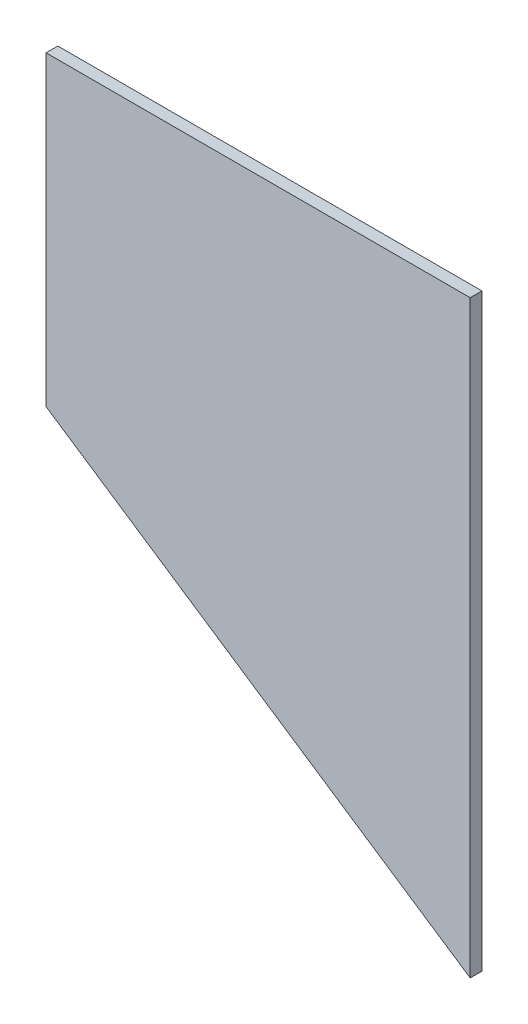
ISO-10303-21;
HEADER;
FILE_DESCRIPTION(('STEP AP214'),'2;1');
FILE_NAME('part.step','',(''),(''),'','','');
FILE_SCHEMA(('AUTOMOTIVE_DESIGN { 1 0 10303 214 1 1 1 1 }'));
ENDSEC;
DATA;
#1=APPLICATION_CONTEXT('core data for automotive mechanical design processes');
#2=APPLICATION_PROTOCOL_DEFINITION('international standard','automotive_design',2000,#1);
#3=PRODUCT_CONTEXT('',#1,'mechanical');
#4=PRODUCT('Part','Part','',(#3));
#5=PRODUCT_RELATED_PRODUCT_CATEGORY('part','',(#4));
#6=PRODUCT_DEFINITION_FORMATION('','',#4);
#7=PRODUCT_DEFINITION_CONTEXT('part definition',#1,'design');
#8=PRODUCT_DEFINITION('design','',#6,#7);
#9=PRODUCT_DEFINITION_SHAPE('','',#8);
#10=(LENGTH_UNIT() NAMED_UNIT(*) SI_UNIT(.MILLI.,.METRE.));
#11=(NAMED_UNIT(*) PLANE_ANGLE_UNIT() SI_UNIT($,.RADIAN.));
#12=(NAMED_UNIT(*) SI_UNIT($,.STERADIAN.) SOLID_ANGLE_UNIT());
#13=UNCERTAINTY_MEASURE_WITH_UNIT(LENGTH_MEASURE(1.E-05),#10,'distance_accuracy_value','');
#14=(GEOMETRIC_REPRESENTATION_CONTEXT(3) GLOBAL_UNCERTAINTY_ASSIGNED_CONTEXT((#13)) GLOBAL_UNIT_ASSIGNED_CONTEXT((#10,
#11,#12)) REPRESENTATION_CONTEXT('',''));
#15=CARTESIAN_POINT('',(0.,0.,0.));
#16=DIRECTION('',(0.,0.,1.));
#17=DIRECTION('',(1.,0.,0.));
#18=AXIS2_PLACEMENT_3D('',#15,#16,#17);
#19=CARTESIAN_POINT('',(304.8,0.,0.));
#20=DIRECTION('',(-1.,0.,0.));
#21=DIRECTION('',(0.,0.,1.));
#22=AXIS2_PLACEMENT_3D('',#19,#20,#21);
#23=PLANE('',#22);
#24=DIRECTION('',(0.,0.,-1.));
#25=VECTOR('',#24,1.);
#26=CARTESIAN_POINT('',(304.8,-158.75,152.4));
#27=LINE('',#26,#25);
#28=CARTESIAN_POINT('',(304.8,-158.75,158.75));
#29=VERTEX_POINT('',#28);
#30=CARTESIAN_POINT('',(304.8,-158.75,152.4));
#31=VERTEX_POINT('',#30);
#32=EDGE_CURVE('E128',#29,#31,#27,.T.);
#33=ORIENTED_EDGE('',*,*,#32,.T.);
#34=DIRECTION('',(0.,1.,0.));
#35=VECTOR('',#34,1.);
#36=CARTESIAN_POINT('',(304.8,-158.75,152.4));
#37=LINE('',#36,#35);
#38=CARTESIAN_POINT('',(304.8,158.75,152.4));
#39=VERTEX_POINT('',#38);
#40=EDGE_CURVE('E12',#31,#39,#37,.T.);
#41=ORIENTED_EDGE('',*,*,#40,.T.);
#42=DIRECTION('',(0.,0.,1.));
#43=VECTOR('',#42,1.);
#44=CARTESIAN_POINT('',(304.8,158.75,152.4));
#45=LINE('',#44,#43);
#46=CARTESIAN_POINT('',(304.8,158.75,158.75));
#47=VERTEX_POINT('',#46);
#48=EDGE_CURVE('E64',#39,#47,#45,.T.);
#49=ORIENTED_EDGE('',*,*,#48,.T.);
#50=DIRECTION('',(0.,-1.,0.));
#51=VECTOR('',#50,1.);
#52=CARTESIAN_POINT('',(304.8,-158.75,158.75));
#53=LINE('',#52,#51);
#54=EDGE_CURVE('E72',#47,#29,#53,.T.);
#55=ORIENTED_EDGE('',*,*,#54,.T.);
#56=EDGE_LOOP('',(#33,#41,#49,#55));
#57=FACE_BOUND('',#56,.T.);
#58=ADVANCED_FACE('F52',(#57),#23,.F.);
#59=CARTESIAN_POINT('',(0.,0.,0.));
#60=DIRECTION('',(-1.,0.,0.));
#61=DIRECTION('',(0.,0.,1.));
#62=AXIS2_PLACEMENT_3D('',#59,#60,#61);
#63=PLANE('',#62);
#64=DIRECTION('',(0.,0.,-1.));
#65=VECTOR('',#64,1.);
#66=CARTESIAN_POINT('',(0.,-82.55,76.2));
#67=LINE('',#66,#65);
#68=CARTESIAN_POINT('',(0.,-82.55,82.55));
#69=VERTEX_POINT('',#68);
#70=CARTESIAN_POINT('',(0.,-82.55,76.2));
#71=VERTEX_POINT('',#70);
#72=EDGE_CURVE('E105',#69,#71,#67,.T.);
#73=ORIENTED_EDGE('',*,*,#72,.F.);
#74=DIRECTION('',(0.,-1.,0.));
#75=VECTOR('',#74,1.);
#76=CARTESIAN_POINT('',(0.,-82.55,82.55));
#77=LINE('',#76,#75);
#78=CARTESIAN_POINT('',(0.,82.55,82.55));
#79=VERTEX_POINT('',#78);
#80=EDGE_CURVE('E123',#79,#69,#77,.T.);
#81=ORIENTED_EDGE('',*,*,#80,.F.);
#82=DIRECTION('',(0.,0.,1.));
#83=VECTOR('',#82,1.);
#84=CARTESIAN_POINT('',(0.,82.55,76.2));
#85=LINE('',#84,#83);
#86=CARTESIAN_POINT('',(0.,82.55,76.2));
#87=VERTEX_POINT('',#86);
#88=EDGE_CURVE('E102',#87,#79,#85,.T.);
#89=ORIENTED_EDGE('',*,*,#88,.F.);
#90=DIRECTION('',(0.,1.,0.));
#91=VECTOR('',#90,1.);
#92=CARTESIAN_POINT('',(0.,-82.55,76.2));
#93=LINE('',#92,#91);
#94=EDGE_CURVE('E100',#71,#87,#93,.T.);
#95=ORIENTED_EDGE('',*,*,#94,.F.);
#96=EDGE_LOOP('',(#73,#81,#89,#95));
#97=FACE_BOUND('',#96,.T.);
#98=ADVANCED_FACE('F99',(#97),#63,.T.);
#99=CARTESIAN_POINT('',(-19.4235294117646,77.6941176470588,0.));
#100=DIRECTION('',(0.242535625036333,-0.970142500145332,0.));
#101=DIRECTION('',(0.970142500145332,0.242535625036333,0.));
#102=AXIS2_PLACEMENT_3D('',#99,#100,#101);
#103=PLANE('',#102);
#104=DIRECTION('',(0.942809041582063,0.235702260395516,0.235702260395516));
#105=VECTOR('',#104,1.);
#106=CARTESIAN_POINT('',(0.,82.55,82.55));
#107=LINE('',#106,#105);
#108=EDGE_CURVE('E112',#79,#47,#107,.T.);
#109=ORIENTED_EDGE('',*,*,#108,.T.);
#110=ORIENTED_EDGE('',*,*,#48,.F.);
#111=DIRECTION('',(0.942809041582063,0.235702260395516,0.235702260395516));
#112=VECTOR('',#111,1.);
#113=CARTESIAN_POINT('',(0.,82.55,76.2));
#114=LINE('',#113,#112);
#115=EDGE_CURVE('E137',#87,#39,#114,.T.);
#116=ORIENTED_EDGE('',*,*,#115,.F.);
#117=ORIENTED_EDGE('',*,*,#88,.T.);
#118=EDGE_LOOP('',(#109,#110,#116,#117));
#119=FACE_BOUND('',#118,.T.);
#120=ADVANCED_FACE('F158',(#119),#103,.F.);
#121=CARTESIAN_POINT('',(-17.929411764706,0.,71.7176470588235));
#122=DIRECTION('',(-0.242535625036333,0.,0.970142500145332));
#123=DIRECTION('',(0.970142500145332,0.,0.242535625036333));
#124=AXIS2_PLACEMENT_3D('',#121,#122,#123);
#125=PLANE('',#124);
#126=ORIENTED_EDGE('',*,*,#115,.T.);
#127=ORIENTED_EDGE('',*,*,#40,.F.);
#128=DIRECTION('',(0.942809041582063,-0.235702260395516,0.235702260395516));
#129=VECTOR('',#128,1.);
#130=CARTESIAN_POINT('',(0.,-82.55,76.2));
#131=LINE('',#130,#129);
#132=EDGE_CURVE('E116',#71,#31,#131,.T.);
#133=ORIENTED_EDGE('',*,*,#132,.F.);
#134=ORIENTED_EDGE('',*,*,#94,.T.);
#135=EDGE_LOOP('',(#126,#127,#133,#134));
#136=FACE_BOUND('',#135,.T.);
#137=ADVANCED_FACE('F130',(#136),#125,.F.);
#138=CARTESIAN_POINT('',(-19.4235294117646,0.,77.6941176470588));
#139=DIRECTION('',(0.242535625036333,0.,-0.970142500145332));
#140=DIRECTION('',(-0.970142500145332,0.,-0.242535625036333));
#141=AXIS2_PLACEMENT_3D('',#138,#139,#140);
#142=PLANE('',#141);
#143=DIRECTION('',(0.942809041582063,-0.235702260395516,0.235702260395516));
#144=VECTOR('',#143,1.);
#145=CARTESIAN_POINT('',(0.,-82.55,82.55));
#146=LINE('',#145,#144);
#147=EDGE_CURVE('E121',#69,#29,#146,.T.);
#148=ORIENTED_EDGE('',*,*,#147,.T.);
#149=ORIENTED_EDGE('',*,*,#54,.F.);
#150=ORIENTED_EDGE('',*,*,#108,.F.);
#151=ORIENTED_EDGE('',*,*,#80,.T.);
#152=EDGE_LOOP('',(#148,#149,#150,#151));
#153=FACE_BOUND('',#152,.T.);
#154=ADVANCED_FACE('F190',(#153),#142,.F.);
#155=CARTESIAN_POINT('',(-19.4235294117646,-77.6941176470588,0.));
#156=DIRECTION('',(0.242535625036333,0.970142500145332,0.));
#157=DIRECTION('',(-0.970142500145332,0.242535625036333,0.));
#158=AXIS2_PLACEMENT_3D('',#155,#156,#157);
#159=PLANE('',#158);
#160=ORIENTED_EDGE('',*,*,#132,.T.);
#161=ORIENTED_EDGE('',*,*,#32,.F.);
#162=ORIENTED_EDGE('',*,*,#147,.F.);
#163=ORIENTED_EDGE('',*,*,#72,.T.);
#164=EDGE_LOOP('',(#160,#161,#162,#163));
#165=FACE_BOUND('',#164,.T.);
#166=ADVANCED_FACE('F119',(#165),#159,.F.);
#167=CLOSED_SHELL('',(#58,#98,#120,#137,#154,#166));
#168=MANIFOLD_SOLID_BREP('B2',#167);
#169=ADVANCED_BREP_SHAPE_REPRESENTATION('',(#18,#168),#14);
#170=SHAPE_DEFINITION_REPRESENTATION(#9,#169);
ENDSEC;
END-ISO-10303-21;
